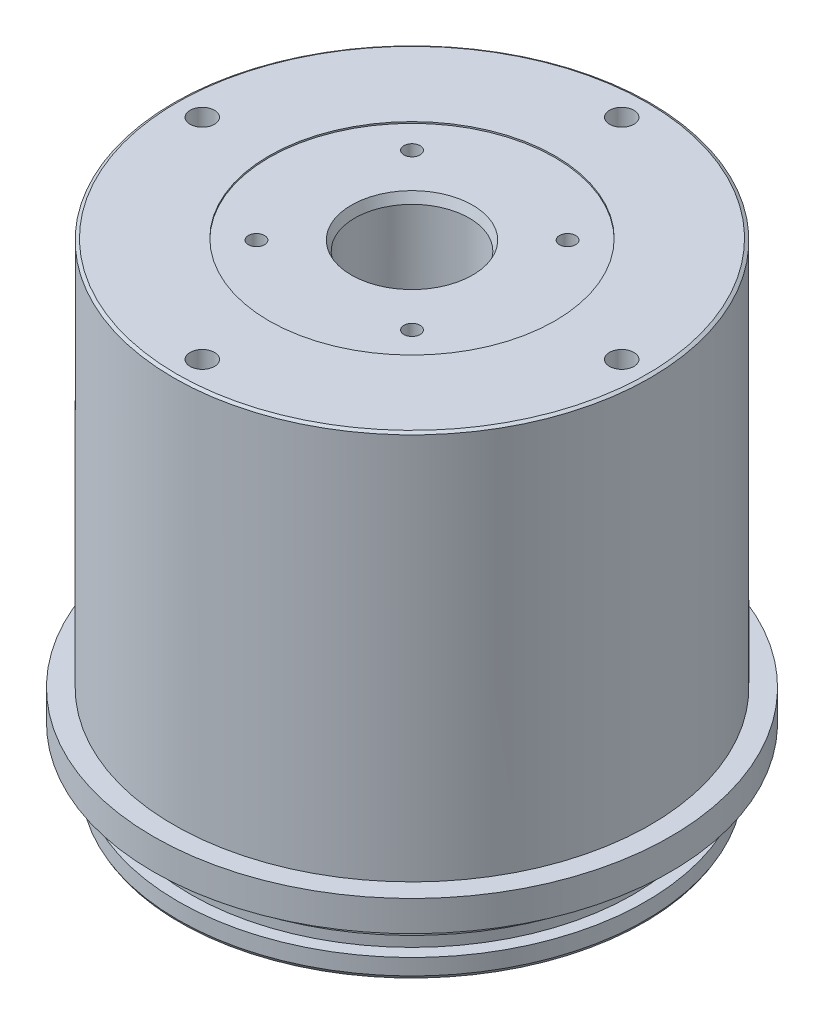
ISO-10303-21;
HEADER;
FILE_DESCRIPTION(('STEP AP214'),'2;1');
FILE_NAME('part.step','',(''),(''),'','','');
FILE_SCHEMA(('AUTOMOTIVE_DESIGN { 1 0 10303 214 1 1 1 1 }'));
ENDSEC;
DATA;
#1=APPLICATION_CONTEXT('core data for automotive mechanical design processes');
#2=APPLICATION_PROTOCOL_DEFINITION('international standard','automotive_design',2000,#1);
#3=PRODUCT_CONTEXT('',#1,'mechanical');
#4=PRODUCT('Part','Part','',(#3));
#5=PRODUCT_RELATED_PRODUCT_CATEGORY('part','',(#4));
#6=PRODUCT_DEFINITION_FORMATION('','',#4);
#7=PRODUCT_DEFINITION_CONTEXT('part definition',#1,'design');
#8=PRODUCT_DEFINITION('design','',#6,#7);
#9=PRODUCT_DEFINITION_SHAPE('','',#8);
#10=(LENGTH_UNIT() NAMED_UNIT(*) SI_UNIT(.MILLI.,.METRE.));
#11=(NAMED_UNIT(*) PLANE_ANGLE_UNIT() SI_UNIT($,.RADIAN.));
#12=(NAMED_UNIT(*) SI_UNIT($,.STERADIAN.) SOLID_ANGLE_UNIT());
#13=UNCERTAINTY_MEASURE_WITH_UNIT(LENGTH_MEASURE(1.E-05),#10,'distance_accuracy_value','');
#14=(GEOMETRIC_REPRESENTATION_CONTEXT(3) GLOBAL_UNCERTAINTY_ASSIGNED_CONTEXT((#13)) GLOBAL_UNIT_ASSIGNED_CONTEXT((#10,
#11,#12)) REPRESENTATION_CONTEXT('',''));
#15=CARTESIAN_POINT('',(0.,0.,0.));
#16=DIRECTION('',(0.,0.,1.));
#17=DIRECTION('',(1.,0.,0.));
#18=AXIS2_PLACEMENT_3D('',#15,#16,#17);
#19=CARTESIAN_POINT('',(0.,0.,0.));
#20=DIRECTION('',(0.,1.00000000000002,0.));
#21=DIRECTION('',(0.,0.,0.999999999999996));
#22=AXIS2_PLACEMENT_3D('',#19,#20,#21);
#23=CYLINDRICAL_SURFACE('',#22,9.525);
#24=CARTESIAN_POINT('',(0.,77.5462,0.));
#25=DIRECTION('',(0.,1.00000000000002,0.));
#26=DIRECTION('',(0.,0.,0.999999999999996));
#27=AXIS2_PLACEMENT_3D('',#24,#25,#26);
#28=CIRCLE('',#27,9.525);
#29=CARTESIAN_POINT('',(0.,77.5462,9.52499999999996));
#30=VERTEX_POINT('',#29);
#31=EDGE_CURVE('E64',#30,#30,#28,.T.);
#32=ORIENTED_EDGE('',*,*,#31,.T.);
#33=EDGE_LOOP('',(#32));
#34=FACE_BOUND('',#33,.T.);
#35=CARTESIAN_POINT('',(0.,63.5000000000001,0.));
#36=DIRECTION('',(0.,-1.00000000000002,0.));
#37=DIRECTION('',(0.,0.,-0.999999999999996));
#38=AXIS2_PLACEMENT_3D('',#35,#36,#37);
#39=CIRCLE('',#38,9.525);
#40=CARTESIAN_POINT('',(0.,63.5000000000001,-9.52499999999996));
#41=VERTEX_POINT('',#40);
#42=EDGE_CURVE('E77',#41,#41,#39,.T.);
#43=ORIENTED_EDGE('',*,*,#42,.T.);
#44=EDGE_LOOP('',(#43));
#45=FACE_BOUND('',#44,.T.);
#46=ADVANCED_FACE('F44',(#34,#45),#23,.F.);
#47=CARTESIAN_POINT('',(0.,0.,0.));
#48=DIRECTION('',(0.,-1.00000000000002,0.));
#49=DIRECTION('',(0.,0.,-0.999999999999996));
#50=AXIS2_PLACEMENT_3D('',#47,#48,#49);
#51=PLANE('',#50);
#52=CARTESIAN_POINT('',(0.,0.,0.));
#53=DIRECTION('',(0.,-1.00000000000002,0.));
#54=DIRECTION('',(0.,0.,-0.999999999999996));
#55=AXIS2_PLACEMENT_3D('',#52,#53,#54);
#56=CIRCLE('',#55,38.6322060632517);
#57=CARTESIAN_POINT('',(0.,0.,-38.6322060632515));
#58=VERTEX_POINT('',#57);
#59=EDGE_CURVE('E73',#58,#58,#56,.T.);
#60=ORIENTED_EDGE('',*,*,#59,.T.);
#61=EDGE_LOOP('',(#60));
#62=FACE_BOUND('',#61,.T.);
#63=CARTESIAN_POINT('',(0.,0.,0.));
#64=DIRECTION('',(0.,-1.00000000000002,0.));
#65=DIRECTION('',(0.,0.,-0.999999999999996));
#66=AXIS2_PLACEMENT_3D('',#63,#64,#65);
#67=CIRCLE('',#66,31.75);
#68=CARTESIAN_POINT('',(0.,0.,-31.7499999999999));
#69=VERTEX_POINT('',#68);
#70=EDGE_CURVE('E80',#69,#69,#67,.T.);
#71=ORIENTED_EDGE('',*,*,#70,.F.);
#72=EDGE_LOOP('',(#71));
#73=FACE_BOUND('',#72,.T.);
#74=ADVANCED_FACE('F264',(#62,#73),#51,.T.);
#75=CARTESIAN_POINT('',(0.,0.,0.));
#76=DIRECTION('',(0.,-1.00000000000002,0.));
#77=DIRECTION('',(0.,0.,-0.999999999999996));
#78=AXIS2_PLACEMENT_3D('',#75,#76,#77);
#79=CYLINDRICAL_SURFACE('',#78,38.9255);
#80=CARTESIAN_POINT('',(0.,0.507999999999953,0.));
#81=DIRECTION('',(0.,-1.00000000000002,0.));
#82=DIRECTION('',(0.,0.,-0.999999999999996));
#83=AXIS2_PLACEMENT_3D('',#80,#81,#82);
#84=CIRCLE('',#83,38.9255);
#85=CARTESIAN_POINT('',(0.,0.507999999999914,-38.9254999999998));
#86=VERTEX_POINT('',#85);
#87=EDGE_CURVE('E70',#86,#86,#84,.F.);
#88=ORIENTED_EDGE('',*,*,#87,.T.);
#89=EDGE_LOOP('',(#88));
#90=FACE_BOUND('',#89,.T.);
#91=CARTESIAN_POINT('',(0.,3.17499999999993,0.));
#92=DIRECTION('',(0.,-1.00000000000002,0.));
#93=DIRECTION('',(0.,0.,-0.999999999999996));
#94=AXIS2_PLACEMENT_3D('',#91,#92,#93);
#95=CIRCLE('',#94,38.9255);
#96=CARTESIAN_POINT('',(0.,3.17499999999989,-38.9254999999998));
#97=VERTEX_POINT('',#96);
#98=EDGE_CURVE('E76',#97,#97,#95,.T.);
#99=ORIENTED_EDGE('',*,*,#98,.T.);
#100=EDGE_LOOP('',(#99));
#101=FACE_BOUND('',#100,.T.);
#102=ADVANCED_FACE('F270',(#90,#101),#79,.T.);
#103=CARTESIAN_POINT('',(38.9254999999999,3.17499999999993,0.));
#104=DIRECTION('',(0.,1.00000000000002,0.));
#105=DIRECTION('',(0.,0.,0.999999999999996));
#106=AXIS2_PLACEMENT_3D('',#103,#104,#105);
#107=PLANE('',#106);
#108=CARTESIAN_POINT('',(0.,3.17499999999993,0.));
#109=DIRECTION('',(0.,-1.00000000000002,0.));
#110=DIRECTION('',(0.,0.,-0.999999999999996));
#111=AXIS2_PLACEMENT_3D('',#108,#109,#110);
#112=CIRCLE('',#111,36.8681);
#113=CARTESIAN_POINT('',(0.,3.17499999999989,-36.8680999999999));
#114=VERTEX_POINT('',#113);
#115=EDGE_CURVE('E84',#114,#114,#112,.T.);
#116=ORIENTED_EDGE('',*,*,#115,.T.);
#117=EDGE_LOOP('',(#116));
#118=FACE_BOUND('',#117,.T.);
#119=ORIENTED_EDGE('',*,*,#98,.F.);
#120=EDGE_LOOP('',(#119));
#121=FACE_BOUND('',#120,.T.);
#122=ADVANCED_FACE('F325',(#118,#121),#107,.T.);
#123=CARTESIAN_POINT('',(0.,0.,0.));
#124=DIRECTION('',(0.,-1.00000000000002,0.));
#125=DIRECTION('',(0.,0.,-0.999999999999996));
#126=AXIS2_PLACEMENT_3D('',#123,#124,#125);
#127=CYLINDRICAL_SURFACE('',#126,36.8681);
#128=CARTESIAN_POINT('',(0.,6.35000000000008,0.));
#129=DIRECTION('',(0.,-1.00000000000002,0.));
#130=DIRECTION('',(0.,0.,-0.999999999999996));
#131=AXIS2_PLACEMENT_3D('',#128,#129,#130);
#132=CIRCLE('',#131,36.8681);
#133=CARTESIAN_POINT('',(0.,6.35000000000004,-36.8680999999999));
#134=VERTEX_POINT('',#133);
#135=EDGE_CURVE('E87',#134,#134,#132,.T.);
#136=ORIENTED_EDGE('',*,*,#135,.T.);
#137=EDGE_LOOP('',(#136));
#138=FACE_BOUND('',#137,.T.);
#139=ORIENTED_EDGE('',*,*,#115,.F.);
#140=EDGE_LOOP('',(#139));
#141=FACE_BOUND('',#140,.T.);
#142=ADVANCED_FACE('F321',(#138,#141),#127,.T.);
#143=CARTESIAN_POINT('',(36.8681,6.35000000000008,0.));
#144=DIRECTION('',(0.,-1.00000000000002,0.));
#145=DIRECTION('',(0.,0.,-0.999999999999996));
#146=AXIS2_PLACEMENT_3D('',#143,#144,#145);
#147=PLANE('',#146);
#148=CARTESIAN_POINT('',(0.,6.35000000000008,0.));
#149=DIRECTION('',(0.,-1.00000000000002,0.));
#150=DIRECTION('',(0.,0.,-0.999999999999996));
#151=AXIS2_PLACEMENT_3D('',#148,#149,#150);
#152=CIRCLE('',#151,38.9255);
#153=CARTESIAN_POINT('',(0.,6.35000000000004,-38.9254999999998));
#154=VERTEX_POINT('',#153);
#155=EDGE_CURVE('E90',#154,#154,#152,.T.);
#156=ORIENTED_EDGE('',*,*,#155,.T.);
#157=EDGE_LOOP('',(#156));
#158=FACE_BOUND('',#157,.T.);
#159=ORIENTED_EDGE('',*,*,#135,.F.);
#160=EDGE_LOOP('',(#159));
#161=FACE_BOUND('',#160,.T.);
#162=ADVANCED_FACE('F317',(#158,#161),#147,.T.);
#163=CARTESIAN_POINT('',(0.,0.,0.));
#164=DIRECTION('',(0.,-1.00000000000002,0.));
#165=DIRECTION('',(0.,0.,-0.999999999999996));
#166=AXIS2_PLACEMENT_3D('',#163,#164,#165);
#167=CYLINDRICAL_SURFACE('',#166,38.9255);
#168=CARTESIAN_POINT('',(0.,9.52500000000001,0.));
#169=DIRECTION('',(0.,-1.00000000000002,0.));
#170=DIRECTION('',(0.,0.,-0.999999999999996));
#171=AXIS2_PLACEMENT_3D('',#168,#169,#170);
#172=CIRCLE('',#171,38.9255);
#173=CARTESIAN_POINT('',(0.,9.52499999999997,-38.9254999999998));
#174=VERTEX_POINT('',#173);
#175=EDGE_CURVE('E93',#174,#174,#172,.T.);
#176=ORIENTED_EDGE('',*,*,#175,.T.);
#177=EDGE_LOOP('',(#176));
#178=FACE_BOUND('',#177,.T.);
#179=ORIENTED_EDGE('',*,*,#155,.F.);
#180=EDGE_LOOP('',(#179));
#181=FACE_BOUND('',#180,.T.);
#182=ADVANCED_FACE('F313',(#178,#181),#167,.T.);
#183=CARTESIAN_POINT('',(38.9254999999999,9.52500000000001,0.));
#184=DIRECTION('',(0.,-1.00000000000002,0.));
#185=DIRECTION('',(0.,0.,-0.999999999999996));
#186=AXIS2_PLACEMENT_3D('',#183,#184,#185);
#187=PLANE('',#186);
#188=CARTESIAN_POINT('',(0.,9.52500000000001,0.));
#189=DIRECTION('',(0.,-1.00000000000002,0.));
#190=DIRECTION('',(0.,0.,-0.999999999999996));
#191=AXIS2_PLACEMENT_3D('',#188,#189,#190);
#192=CIRCLE('',#191,40.005);
#193=CARTESIAN_POINT('',(0.,9.52499999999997,-40.0049999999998));
#194=VERTEX_POINT('',#193);
#195=EDGE_CURVE('E96',#194,#194,#192,.T.);
#196=ORIENTED_EDGE('',*,*,#195,.T.);
#197=EDGE_LOOP('',(#196));
#198=FACE_BOUND('',#197,.T.);
#199=ORIENTED_EDGE('',*,*,#175,.F.);
#200=EDGE_LOOP('',(#199));
#201=FACE_BOUND('',#200,.T.);
#202=ADVANCED_FACE('F309',(#198,#201),#187,.T.);
#203=CARTESIAN_POINT('',(0.,0.,0.));
#204=DIRECTION('',(0.,-1.00000000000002,0.));
#205=DIRECTION('',(0.,0.,-0.999999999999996));
#206=AXIS2_PLACEMENT_3D('',#203,#204,#205);
#207=CYLINDRICAL_SURFACE('',#206,40.005);
#208=CARTESIAN_POINT('',(0.,10.6679999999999,0.));
#209=DIRECTION('',(0.,-1.00000000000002,0.));
#210=DIRECTION('',(0.,0.,-0.999999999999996));
#211=AXIS2_PLACEMENT_3D('',#208,#209,#210);
#212=CIRCLE('',#211,40.005);
#213=CARTESIAN_POINT('',(0.,10.6679999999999,-40.0049999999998));
#214=VERTEX_POINT('',#213);
#215=EDGE_CURVE('E99',#214,#214,#212,.T.);
#216=ORIENTED_EDGE('',*,*,#215,.T.);
#217=EDGE_LOOP('',(#216));
#218=FACE_BOUND('',#217,.T.);
#219=ORIENTED_EDGE('',*,*,#195,.F.);
#220=EDGE_LOOP('',(#219));
#221=FACE_BOUND('',#220,.T.);
#222=ADVANCED_FACE('F305',(#218,#221),#207,.T.);
#223=CARTESIAN_POINT('',(40.005,10.6679999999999,0.));
#224=DIRECTION('',(0.,-1.00000000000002,0.));
#225=DIRECTION('',(0.,0.,-0.999999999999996));
#226=AXIS2_PLACEMENT_3D('',#223,#224,#225);
#227=PLANE('',#226);
#228=CARTESIAN_POINT('',(0.,10.6679999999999,0.));
#229=DIRECTION('',(0.,-1.00000000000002,0.));
#230=DIRECTION('',(0.,0.,-0.999999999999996));
#231=AXIS2_PLACEMENT_3D('',#228,#229,#230);
#232=CIRCLE('',#231,42.037);
#233=CARTESIAN_POINT('',(0.,10.6679999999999,-42.0369999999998));
#234=VERTEX_POINT('',#233);
#235=EDGE_CURVE('E102',#234,#234,#232,.T.);
#236=ORIENTED_EDGE('',*,*,#235,.T.);
#237=EDGE_LOOP('',(#236));
#238=FACE_BOUND('',#237,.T.);
#239=ORIENTED_EDGE('',*,*,#215,.F.);
#240=EDGE_LOOP('',(#239));
#241=FACE_BOUND('',#240,.T.);
#242=ADVANCED_FACE('F301',(#238,#241),#227,.T.);
#243=CARTESIAN_POINT('',(0.,0.,0.));
#244=DIRECTION('',(0.,-1.00000000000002,0.));
#245=DIRECTION('',(0.,0.,-0.999999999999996));
#246=AXIS2_PLACEMENT_3D('',#243,#244,#245);
#247=CYLINDRICAL_SURFACE('',#246,42.037);
#248=CARTESIAN_POINT('',(0.,9.52500000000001,0.));
#249=DIRECTION('',(0.,-1.00000000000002,0.));
#250=DIRECTION('',(0.,0.,-0.999999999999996));
#251=AXIS2_PLACEMENT_3D('',#248,#249,#250);
#252=CIRCLE('',#251,42.037);
#253=CARTESIAN_POINT('',(0.,9.52499999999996,-42.0369999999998));
#254=VERTEX_POINT('',#253);
#255=EDGE_CURVE('E105',#254,#254,#252,.T.);
#256=ORIENTED_EDGE('',*,*,#255,.T.);
#257=EDGE_LOOP('',(#256));
#258=FACE_BOUND('',#257,.T.);
#259=ORIENTED_EDGE('',*,*,#235,.F.);
#260=EDGE_LOOP('',(#259));
#261=FACE_BOUND('',#260,.T.);
#262=ADVANCED_FACE('F297',(#258,#261),#247,.F.);
#263=CARTESIAN_POINT('',(42.037,9.52500000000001,0.));
#264=DIRECTION('',(0.,-1.00000000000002,0.));
#265=DIRECTION('',(0.,0.,-0.999999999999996));
#266=AXIS2_PLACEMENT_3D('',#263,#264,#265);
#267=PLANE('',#266);
#268=CARTESIAN_POINT('',(0.,9.52500000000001,0.));
#269=DIRECTION('',(0.,-1.00000000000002,0.));
#270=DIRECTION('',(0.,0.,-0.999999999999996));
#271=AXIS2_PLACEMENT_3D('',#268,#269,#270);
#272=CIRCLE('',#271,43.053);
#273=CARTESIAN_POINT('',(0.,9.52499999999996,-43.0529999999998));
#274=VERTEX_POINT('',#273);
#275=EDGE_CURVE('E108',#274,#274,#272,.T.);
#276=ORIENTED_EDGE('',*,*,#275,.T.);
#277=EDGE_LOOP('',(#276));
#278=FACE_BOUND('',#277,.T.);
#279=ORIENTED_EDGE('',*,*,#255,.F.);
#280=EDGE_LOOP('',(#279));
#281=FACE_BOUND('',#280,.T.);
#282=ADVANCED_FACE('F293',(#278,#281),#267,.T.);
#283=CARTESIAN_POINT('',(0.,0.,0.));
#284=DIRECTION('',(0.,-1.00000000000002,0.));
#285=DIRECTION('',(0.,0.,-0.999999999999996));
#286=AXIS2_PLACEMENT_3D('',#283,#284,#285);
#287=CYLINDRICAL_SURFACE('',#286,43.053);
#288=CARTESIAN_POINT('',(0.,14.605,0.));
#289=DIRECTION('',(0.,-1.00000000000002,0.));
#290=DIRECTION('',(0.,0.,-0.999999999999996));
#291=AXIS2_PLACEMENT_3D('',#288,#289,#290);
#292=CIRCLE('',#291,43.053);
#293=CARTESIAN_POINT('',(0.,14.6049999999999,-43.0529999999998));
#294=VERTEX_POINT('',#293);
#295=EDGE_CURVE('E111',#294,#294,#292,.T.);
#296=ORIENTED_EDGE('',*,*,#295,.T.);
#297=EDGE_LOOP('',(#296));
#298=FACE_BOUND('',#297,.T.);
#299=ORIENTED_EDGE('',*,*,#275,.F.);
#300=EDGE_LOOP('',(#299));
#301=FACE_BOUND('',#300,.T.);
#302=ADVANCED_FACE('F289',(#298,#301),#287,.T.);
#303=CARTESIAN_POINT('',(43.053,14.605,0.));
#304=DIRECTION('',(0.,1.00000000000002,0.));
#305=DIRECTION('',(0.,0.,0.999999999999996));
#306=AXIS2_PLACEMENT_3D('',#303,#304,#305);
#307=PLANE('',#306);
#308=CARTESIAN_POINT('',(0.,14.605,0.));
#309=DIRECTION('',(0.,-1.00000000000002,0.));
#310=DIRECTION('',(0.,0.,-0.999999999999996));
#311=AXIS2_PLACEMENT_3D('',#308,#309,#310);
#312=CIRCLE('',#311,39.6748);
#313=CARTESIAN_POINT('',(0.,14.6049999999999,-39.6747999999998));
#314=VERTEX_POINT('',#313);
#315=EDGE_CURVE('E114',#314,#314,#312,.T.);
#316=ORIENTED_EDGE('',*,*,#315,.T.);
#317=EDGE_LOOP('',(#316));
#318=FACE_BOUND('',#317,.T.);
#319=ORIENTED_EDGE('',*,*,#295,.F.);
#320=EDGE_LOOP('',(#319));
#321=FACE_BOUND('',#320,.T.);
#322=ADVANCED_FACE('F285',(#318,#321),#307,.T.);
#323=CARTESIAN_POINT('',(0.,0.,0.));
#324=DIRECTION('',(0.,-1.00000000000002,0.));
#325=DIRECTION('',(0.,0.,-0.999999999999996));
#326=AXIS2_PLACEMENT_3D('',#323,#324,#325);
#327=CYLINDRICAL_SURFACE('',#326,39.6748);
#328=CARTESIAN_POINT('',(0.,79.0817060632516,0.));
#329=DIRECTION('',(0.,1.00000000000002,0.));
#330=DIRECTION('',(0.,0.,0.999999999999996));
#331=AXIS2_PLACEMENT_3D('',#328,#329,#330);
#332=CIRCLE('',#331,39.6748);
#333=CARTESIAN_POINT('',(0.,79.0817060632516,39.6747999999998));
#334=VERTEX_POINT('',#333);
#335=EDGE_CURVE('E59',#334,#334,#332,.F.);
#336=ORIENTED_EDGE('',*,*,#335,.T.);
#337=EDGE_LOOP('',(#336));
#338=FACE_BOUND('',#337,.T.);
#339=ORIENTED_EDGE('',*,*,#315,.F.);
#340=EDGE_LOOP('',(#339));
#341=FACE_BOUND('',#340,.T.);
#342=ADVANCED_FACE('F234',(#338,#341),#327,.T.);
#343=CARTESIAN_POINT('',(39.6748,79.375,0.));
#344=DIRECTION('',(0.,1.00000000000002,0.));
#345=DIRECTION('',(0.,0.,0.999999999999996));
#346=AXIS2_PLACEMENT_3D('',#343,#344,#345);
#347=PLANE('',#346);
#348=CARTESIAN_POINT('',(0.,79.375,0.));
#349=DIRECTION('',(0.,1.00000000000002,0.));
#350=DIRECTION('',(0.,0.,0.999999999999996));
#351=AXIS2_PLACEMENT_3D('',#348,#349,#350);
#352=CIRCLE('',#351,39.1668);
#353=CARTESIAN_POINT('',(0.,79.375,39.1667999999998));
#354=VERTEX_POINT('',#353);
#355=EDGE_CURVE('E55',#354,#354,#352,.T.);
#356=ORIENTED_EDGE('',*,*,#355,.T.);
#357=EDGE_LOOP('',(#356));
#358=FACE_BOUND('',#357,.T.);
#359=CARTESIAN_POINT('',(0.,79.375,34.925));
#360=DIRECTION('',(0.,1.00000000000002,0.));
#361=DIRECTION('',(0.,0.,0.999999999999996));
#362=AXIS2_PLACEMENT_3D('',#359,#360,#361);
#363=CIRCLE('',#362,2.032);
#364=CARTESIAN_POINT('',(0.,79.375,36.957));
#365=VERTEX_POINT('',#364);
#366=EDGE_CURVE('E215',#365,#365,#363,.T.);
#367=ORIENTED_EDGE('',*,*,#366,.F.);
#368=EDGE_LOOP('',(#367));
#369=FACE_BOUND('',#368,.T.);
#370=CARTESIAN_POINT('',(34.925,79.375,0.));
#371=DIRECTION('',(0.,1.00000000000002,0.));
#372=DIRECTION('',(0.,0.,0.999999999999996));
#373=AXIS2_PLACEMENT_3D('',#370,#371,#372);
#374=CIRCLE('',#373,2.032);
#375=CARTESIAN_POINT('',(34.925,79.375,2.03199999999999));
#376=VERTEX_POINT('',#375);
#377=EDGE_CURVE('E209',#376,#376,#374,.T.);
#378=ORIENTED_EDGE('',*,*,#377,.F.);
#379=EDGE_LOOP('',(#378));
#380=FACE_BOUND('',#379,.T.);
#381=CARTESIAN_POINT('',(-34.925,79.375,0.));
#382=DIRECTION('',(0.,1.00000000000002,0.));
#383=DIRECTION('',(0.,0.,0.999999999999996));
#384=AXIS2_PLACEMENT_3D('',#381,#382,#383);
#385=CIRCLE('',#384,2.032);
#386=CARTESIAN_POINT('',(-34.925,79.375,2.03199999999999));
#387=VERTEX_POINT('',#386);
#388=EDGE_CURVE('E203',#387,#387,#385,.T.);
#389=ORIENTED_EDGE('',*,*,#388,.F.);
#390=EDGE_LOOP('',(#389));
#391=FACE_BOUND('',#390,.T.);
#392=CARTESIAN_POINT('',(0.,79.375,-34.925));
#393=DIRECTION('',(0.,1.00000000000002,0.));
#394=DIRECTION('',(0.,0.,0.999999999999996));
#395=AXIS2_PLACEMENT_3D('',#392,#393,#394);
#396=CIRCLE('',#395,2.032);
#397=CARTESIAN_POINT('',(0.,79.375,-32.893));
#398=VERTEX_POINT('',#397);
#399=EDGE_CURVE('E197',#398,#398,#396,.T.);
#400=ORIENTED_EDGE('',*,*,#399,.F.);
#401=EDGE_LOOP('',(#400));
#402=FACE_BOUND('',#401,.T.);
#403=CARTESIAN_POINT('',(0.,79.375,0.));
#404=DIRECTION('',(0.,1.00000000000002,0.));
#405=DIRECTION('',(0.,0.,0.999999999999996));
#406=AXIS2_PLACEMENT_3D('',#403,#404,#405);
#407=CIRCLE('',#406,23.8125);
#408=CARTESIAN_POINT('',(0.,79.375,23.8124999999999));
#409=VERTEX_POINT('',#408);
#410=EDGE_CURVE('E167',#409,#409,#407,.T.);
#411=ORIENTED_EDGE('',*,*,#410,.F.);
#412=EDGE_LOOP('',(#411));
#413=FACE_BOUND('',#412,.T.);
#414=ADVANCED_FACE('F230',(#358,#369,#380,#391,#402,#413),#347,.T.);
#415=CARTESIAN_POINT('',(0.,63.5000000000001,0.));
#416=DIRECTION('',(0.,-1.00000000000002,0.));
#417=DIRECTION('',(0.,0.,-0.999999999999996));
#418=AXIS2_PLACEMENT_3D('',#415,#416,#417);
#419=CYLINDRICAL_SURFACE('',#418,31.75);
#420=CARTESIAN_POINT('',(0.,62.23,0.));
#421=DIRECTION('',(0.,-1.00000000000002,0.));
#422=DIRECTION('',(0.,0.,-0.999999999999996));
#423=AXIS2_PLACEMENT_3D('',#420,#421,#422);
#424=CIRCLE('',#423,31.75);
#425=CARTESIAN_POINT('',(0.,62.23,-31.7499999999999));
#426=VERTEX_POINT('',#425);
#427=EDGE_CURVE('E12',#426,#426,#424,.F.);
#428=ORIENTED_EDGE('',*,*,#427,.T.);
#429=EDGE_LOOP('',(#428));
#430=FACE_BOUND('',#429,.T.);
#431=ORIENTED_EDGE('',*,*,#70,.T.);
#432=EDGE_LOOP('',(#431));
#433=FACE_BOUND('',#432,.T.);
#434=ADVANCED_FACE('F233',(#430,#433),#419,.F.);
#435=CARTESIAN_POINT('',(0.,63.5000000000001,0.));
#436=DIRECTION('',(0.,-1.00000000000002,0.));
#437=DIRECTION('',(0.,0.,-0.999999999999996));
#438=AXIS2_PLACEMENT_3D('',#435,#436,#437);
#439=PLANE('',#438);
#440=CARTESIAN_POINT('',(0.,63.5000000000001,0.));
#441=DIRECTION('',(0.,-1.00000000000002,0.));
#442=DIRECTION('',(0.,0.,-0.999999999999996));
#443=AXIS2_PLACEMENT_3D('',#440,#441,#442);
#444=CIRCLE('',#443,30.48);
#445=CARTESIAN_POINT('',(0.,63.5000000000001,-30.4799999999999));
#446=VERTEX_POINT('',#445);
#447=EDGE_CURVE('E51',#446,#446,#444,.T.);
#448=ORIENTED_EDGE('',*,*,#447,.T.);
#449=EDGE_LOOP('',(#448));
#450=FACE_BOUND('',#449,.T.);
#451=CARTESIAN_POINT('',(-17.9605122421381,63.5000000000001,17.9605122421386));
#452=DIRECTION('',(0.,-1.00000000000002,0.));
#453=DIRECTION('',(0.707106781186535,0.,-0.707106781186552));
#454=AXIS2_PLACEMENT_3D('',#451,#452,#453);
#455=CIRCLE('',#454,2.032);
#456=CARTESIAN_POINT('',(-16.5236712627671,63.5000000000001,16.5236712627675));
#457=VERTEX_POINT('',#456);
#458=EDGE_CURVE('E161',#457,#457,#455,.T.);
#459=ORIENTED_EDGE('',*,*,#458,.F.);
#460=EDGE_LOOP('',(#459));
#461=FACE_BOUND('',#460,.T.);
#462=CARTESIAN_POINT('',(-25.4,63.5000000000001,2.22044604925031E-13));
#463=DIRECTION('',(0.,-1.00000000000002,0.));
#464=DIRECTION('',(0.999999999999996,0.,0.));
#465=AXIS2_PLACEMENT_3D('',#462,#463,#464);
#466=CIRCLE('',#465,2.032);
#467=CARTESIAN_POINT('',(-23.368,63.5000000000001,2.00760534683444E-13));
#468=VERTEX_POINT('',#467);
#469=EDGE_CURVE('E155',#468,#468,#466,.T.);
#470=ORIENTED_EDGE('',*,*,#469,.F.);
#471=EDGE_LOOP('',(#470));
#472=FACE_BOUND('',#471,.T.);
#473=CARTESIAN_POINT('',(-17.9605122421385,63.5000000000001,-17.9605122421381));
#474=DIRECTION('',(0.,-1.00000000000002,0.));
#475=DIRECTION('',(0.70710678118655,0.,0.707106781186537));
#476=AXIS2_PLACEMENT_3D('',#473,#474,#475);
#477=CIRCLE('',#476,2.032);
#478=CARTESIAN_POINT('',(-16.5236712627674,63.5000000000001,-16.5236712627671));
#479=VERTEX_POINT('',#478);
#480=EDGE_CURVE('E149',#479,#479,#477,.T.);
#481=ORIENTED_EDGE('',*,*,#480,.F.);
#482=EDGE_LOOP('',(#481));
#483=FACE_BOUND('',#482,.T.);
#484=CARTESIAN_POINT('',(0.,63.5000000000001,-25.4));
#485=DIRECTION('',(0.,-1.00000000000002,0.));
#486=DIRECTION('',(0.,0.,0.999999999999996));
#487=AXIS2_PLACEMENT_3D('',#484,#485,#486);
#488=CIRCLE('',#487,2.032);
#489=CARTESIAN_POINT('',(0.,63.5000000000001,-23.368));
#490=VERTEX_POINT('',#489);
#491=EDGE_CURVE('E143',#490,#490,#488,.T.);
#492=ORIENTED_EDGE('',*,*,#491,.F.);
#493=EDGE_LOOP('',(#492));
#494=FACE_BOUND('',#493,.T.);
#495=CARTESIAN_POINT('',(17.9605122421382,63.5000000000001,-17.9605122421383));
#496=DIRECTION('',(0.,-1.00000000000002,0.));
#497=DIRECTION('',(-0.70710678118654,0.,0.707106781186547));
#498=AXIS2_PLACEMENT_3D('',#495,#496,#497);
#499=CIRCLE('',#498,2.032);
#500=CARTESIAN_POINT('',(16.5236712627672,63.5000000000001,-16.5236712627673));
#501=VERTEX_POINT('',#500);
#502=EDGE_CURVE('E137',#501,#501,#499,.T.);
#503=ORIENTED_EDGE('',*,*,#502,.F.);
#504=EDGE_LOOP('',(#503));
#505=FACE_BOUND('',#504,.T.);
#506=CARTESIAN_POINT('',(25.4,63.5000000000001,-1.11022302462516E-13));
#507=DIRECTION('',(0.,-1.00000000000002,0.));
#508=DIRECTION('',(-0.999999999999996,0.,0.));
#509=AXIS2_PLACEMENT_3D('',#506,#507,#508);
#510=CIRCLE('',#509,2.032);
#511=CARTESIAN_POINT('',(23.368,63.5000000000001,-1.03927612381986E-13));
#512=VERTEX_POINT('',#511);
#513=EDGE_CURVE('E131',#512,#512,#510,.T.);
#514=ORIENTED_EDGE('',*,*,#513,.F.);
#515=EDGE_LOOP('',(#514));
#516=FACE_BOUND('',#515,.T.);
#517=CARTESIAN_POINT('',(17.9605122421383,63.5000000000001,17.9605122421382));
#518=DIRECTION('',(0.,-1.00000000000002,0.));
#519=DIRECTION('',(-0.707106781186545,0.,-0.707106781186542));
#520=AXIS2_PLACEMENT_3D('',#517,#518,#519);
#521=CIRCLE('',#520,2.032);
#522=CARTESIAN_POINT('',(16.5236712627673,63.5000000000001,16.5236712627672));
#523=VERTEX_POINT('',#522);
#524=EDGE_CURVE('E125',#523,#523,#521,.T.);
#525=ORIENTED_EDGE('',*,*,#524,.F.);
#526=EDGE_LOOP('',(#525));
#527=FACE_BOUND('',#526,.T.);
#528=CARTESIAN_POINT('',(0.,63.5000000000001,25.4));
#529=DIRECTION('',(0.,-1.00000000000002,0.));
#530=DIRECTION('',(0.,0.,-0.999999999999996));
#531=AXIS2_PLACEMENT_3D('',#528,#529,#530);
#532=CIRCLE('',#531,2.032);
#533=CARTESIAN_POINT('',(0.,63.5000000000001,23.368));
#534=VERTEX_POINT('',#533);
#535=EDGE_CURVE('E119',#534,#534,#532,.T.);
#536=ORIENTED_EDGE('',*,*,#535,.F.);
#537=EDGE_LOOP('',(#536));
#538=FACE_BOUND('',#537,.T.);
#539=ORIENTED_EDGE('',*,*,#42,.F.);
#540=EDGE_LOOP('',(#539));
#541=FACE_BOUND('',#540,.T.);
#542=ADVANCED_FACE('F278',(#450,#461,#472,#483,#494,#505,#516,#527,#538,#541),#439,.T.);
#543=CARTESIAN_POINT('',(0.,73.0250000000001,25.4));
#544=DIRECTION('',(0.,-1.00000000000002,0.));
#545=DIRECTION('',(0.,0.,-0.999999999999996));
#546=AXIS2_PLACEMENT_3D('',#543,#544,#545);
#547=CYLINDRICAL_SURFACE('',#546,2.032);
#548=CARTESIAN_POINT('',(0.,73.0250000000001,25.4));
#549=DIRECTION('',(0.,-1.00000000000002,0.));
#550=DIRECTION('',(0.,0.,-0.999999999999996));
#551=AXIS2_PLACEMENT_3D('',#548,#549,#550);
#552=CIRCLE('',#551,2.032);
#553=CARTESIAN_POINT('',(0.,73.0250000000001,23.368));
#554=VERTEX_POINT('',#553);
#555=EDGE_CURVE('E81',#554,#554,#552,.T.);
#556=ORIENTED_EDGE('',*,*,#555,.F.);
#557=EDGE_LOOP('',(#556));
#558=FACE_BOUND('',#557,.T.);
#559=ORIENTED_EDGE('',*,*,#535,.T.);
#560=EDGE_LOOP('',(#559));
#561=FACE_BOUND('',#560,.T.);
#562=ADVANCED_FACE('F276',(#558,#561),#547,.F.);
#563=CARTESIAN_POINT('',(0.,73.0250000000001,25.4));
#564=DIRECTION('',(0.,-1.00000000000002,0.));
#565=DIRECTION('',(0.,0.,-0.999999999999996));
#566=AXIS2_PLACEMENT_3D('',#563,#564,#565);
#567=PLANE('',#566);
#568=ORIENTED_EDGE('',*,*,#555,.T.);
#569=EDGE_LOOP('',(#568));
#570=FACE_BOUND('',#569,.T.);
#571=ADVANCED_FACE('F686',(#570),#567,.T.);
#572=CARTESIAN_POINT('',(17.9605122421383,73.0250000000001,17.9605122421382));
#573=DIRECTION('',(0.,-1.00000000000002,0.));
#574=DIRECTION('',(0.,0.,-0.999999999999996));
#575=AXIS2_PLACEMENT_3D('',#572,#573,#574);
#576=CYLINDRICAL_SURFACE('',#575,2.032);
#577=CARTESIAN_POINT('',(17.9605122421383,73.0250000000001,17.9605122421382));
#578=DIRECTION('',(0.,-1.00000000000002,0.));
#579=DIRECTION('',(-0.707106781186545,0.,-0.707106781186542));
#580=AXIS2_PLACEMENT_3D('',#577,#578,#579);
#581=CIRCLE('',#580,2.032);
#582=CARTESIAN_POINT('',(16.5236712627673,73.0250000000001,16.5236712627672));
#583=VERTEX_POINT('',#582);
#584=EDGE_CURVE('E122',#583,#583,#581,.T.);
#585=ORIENTED_EDGE('',*,*,#584,.F.);
#586=EDGE_LOOP('',(#585));
#587=FACE_BOUND('',#586,.T.);
#588=ORIENTED_EDGE('',*,*,#524,.T.);
#589=EDGE_LOOP('',(#588));
#590=FACE_BOUND('',#589,.T.);
#591=ADVANCED_FACE('F677',(#587,#590),#576,.F.);
#592=CARTESIAN_POINT('',(17.9605122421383,73.0250000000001,17.9605122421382));
#593=DIRECTION('',(0.,-1.00000000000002,0.));
#594=DIRECTION('',(-0.707106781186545,0.,-0.707106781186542));
#595=AXIS2_PLACEMENT_3D('',#592,#593,#594);
#596=PLANE('',#595);
#597=ORIENTED_EDGE('',*,*,#584,.T.);
#598=EDGE_LOOP('',(#597));
#599=FACE_BOUND('',#598,.T.);
#600=ADVANCED_FACE('F668',(#599),#596,.T.);
#601=CARTESIAN_POINT('',(25.4,73.0250000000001,-1.11022302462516E-13));
#602=DIRECTION('',(0.,-1.00000000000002,0.));
#603=DIRECTION('',(0.,0.,-0.999999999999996));
#604=AXIS2_PLACEMENT_3D('',#601,#602,#603);
#605=CYLINDRICAL_SURFACE('',#604,2.032);
#606=CARTESIAN_POINT('',(25.4,73.0250000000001,-1.11022302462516E-13));
#607=DIRECTION('',(0.,-1.00000000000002,0.));
#608=DIRECTION('',(-0.999999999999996,0.,0.));
#609=AXIS2_PLACEMENT_3D('',#606,#607,#608);
#610=CIRCLE('',#609,2.032);
#611=CARTESIAN_POINT('',(23.368,73.0250000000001,-1.03927612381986E-13));
#612=VERTEX_POINT('',#611);
#613=EDGE_CURVE('E128',#612,#612,#610,.T.);
#614=ORIENTED_EDGE('',*,*,#613,.F.);
#615=EDGE_LOOP('',(#614));
#616=FACE_BOUND('',#615,.T.);
#617=ORIENTED_EDGE('',*,*,#513,.T.);
#618=EDGE_LOOP('',(#617));
#619=FACE_BOUND('',#618,.T.);
#620=ADVANCED_FACE('F659',(#616,#619),#605,.F.);
#621=CARTESIAN_POINT('',(25.4,73.0250000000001,-1.11022302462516E-13));
#622=DIRECTION('',(0.,-1.00000000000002,0.));
#623=DIRECTION('',(-0.999999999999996,0.,0.));
#624=AXIS2_PLACEMENT_3D('',#621,#622,#623);
#625=PLANE('',#624);
#626=ORIENTED_EDGE('',*,*,#613,.T.);
#627=EDGE_LOOP('',(#626));
#628=FACE_BOUND('',#627,.T.);
#629=ADVANCED_FACE('F650',(#628),#625,.T.);
#630=CARTESIAN_POINT('',(17.9605122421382,73.0250000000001,-17.9605122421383));
#631=DIRECTION('',(0.,-1.00000000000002,0.));
#632=DIRECTION('',(0.,0.,-0.999999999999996));
#633=AXIS2_PLACEMENT_3D('',#630,#631,#632);
#634=CYLINDRICAL_SURFACE('',#633,2.032);
#635=CARTESIAN_POINT('',(17.9605122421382,73.0250000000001,-17.9605122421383));
#636=DIRECTION('',(0.,-1.00000000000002,0.));
#637=DIRECTION('',(-0.70710678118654,0.,0.707106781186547));
#638=AXIS2_PLACEMENT_3D('',#635,#636,#637);
#639=CIRCLE('',#638,2.032);
#640=CARTESIAN_POINT('',(16.5236712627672,73.0250000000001,-16.5236712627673));
#641=VERTEX_POINT('',#640);
#642=EDGE_CURVE('E134',#641,#641,#639,.T.);
#643=ORIENTED_EDGE('',*,*,#642,.F.);
#644=EDGE_LOOP('',(#643));
#645=FACE_BOUND('',#644,.T.);
#646=ORIENTED_EDGE('',*,*,#502,.T.);
#647=EDGE_LOOP('',(#646));
#648=FACE_BOUND('',#647,.T.);
#649=ADVANCED_FACE('F641',(#645,#648),#634,.F.);
#650=CARTESIAN_POINT('',(17.9605122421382,73.0250000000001,-17.9605122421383));
#651=DIRECTION('',(0.,-1.00000000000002,0.));
#652=DIRECTION('',(-0.70710678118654,0.,0.707106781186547));
#653=AXIS2_PLACEMENT_3D('',#650,#651,#652);
#654=PLANE('',#653);
#655=ORIENTED_EDGE('',*,*,#642,.T.);
#656=EDGE_LOOP('',(#655));
#657=FACE_BOUND('',#656,.T.);
#658=ADVANCED_FACE('F632',(#657),#654,.T.);
#659=CARTESIAN_POINT('',(0.,73.0250000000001,-25.4));
#660=DIRECTION('',(0.,-1.00000000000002,0.));
#661=DIRECTION('',(0.,0.,-0.999999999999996));
#662=AXIS2_PLACEMENT_3D('',#659,#660,#661);
#663=CYLINDRICAL_SURFACE('',#662,2.032);
#664=CARTESIAN_POINT('',(0.,73.0250000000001,-25.4));
#665=DIRECTION('',(0.,-1.00000000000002,0.));
#666=DIRECTION('',(0.,0.,0.999999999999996));
#667=AXIS2_PLACEMENT_3D('',#664,#665,#666);
#668=CIRCLE('',#667,2.032);
#669=CARTESIAN_POINT('',(0.,73.0250000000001,-23.368));
#670=VERTEX_POINT('',#669);
#671=EDGE_CURVE('E140',#670,#670,#668,.T.);
#672=ORIENTED_EDGE('',*,*,#671,.F.);
#673=EDGE_LOOP('',(#672));
#674=FACE_BOUND('',#673,.T.);
#675=ORIENTED_EDGE('',*,*,#491,.T.);
#676=EDGE_LOOP('',(#675));
#677=FACE_BOUND('',#676,.T.);
#678=ADVANCED_FACE('F623',(#674,#677),#663,.F.);
#679=CARTESIAN_POINT('',(0.,73.0250000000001,-25.4));
#680=DIRECTION('',(0.,-1.00000000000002,0.));
#681=DIRECTION('',(0.,0.,0.999999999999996));
#682=AXIS2_PLACEMENT_3D('',#679,#680,#681);
#683=PLANE('',#682);
#684=ORIENTED_EDGE('',*,*,#671,.T.);
#685=EDGE_LOOP('',(#684));
#686=FACE_BOUND('',#685,.T.);
#687=ADVANCED_FACE('F614',(#686),#683,.T.);
#688=CARTESIAN_POINT('',(-17.9605122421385,73.0250000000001,-17.9605122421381));
#689=DIRECTION('',(0.,-1.00000000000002,0.));
#690=DIRECTION('',(0.,0.,-0.999999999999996));
#691=AXIS2_PLACEMENT_3D('',#688,#689,#690);
#692=CYLINDRICAL_SURFACE('',#691,2.032);
#693=CARTESIAN_POINT('',(-17.9605122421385,73.0250000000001,-17.9605122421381));
#694=DIRECTION('',(0.,-1.00000000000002,0.));
#695=DIRECTION('',(0.70710678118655,0.,0.707106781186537));
#696=AXIS2_PLACEMENT_3D('',#693,#694,#695);
#697=CIRCLE('',#696,2.032);
#698=CARTESIAN_POINT('',(-16.5236712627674,73.0250000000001,-16.5236712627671));
#699=VERTEX_POINT('',#698);
#700=EDGE_CURVE('E146',#699,#699,#697,.T.);
#701=ORIENTED_EDGE('',*,*,#700,.F.);
#702=EDGE_LOOP('',(#701));
#703=FACE_BOUND('',#702,.T.);
#704=ORIENTED_EDGE('',*,*,#480,.T.);
#705=EDGE_LOOP('',(#704));
#706=FACE_BOUND('',#705,.T.);
#707=ADVANCED_FACE('F605',(#703,#706),#692,.F.);
#708=CARTESIAN_POINT('',(-17.9605122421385,73.0250000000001,-17.9605122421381));
#709=DIRECTION('',(0.,-1.00000000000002,0.));
#710=DIRECTION('',(0.70710678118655,0.,0.707106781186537));
#711=AXIS2_PLACEMENT_3D('',#708,#709,#710);
#712=PLANE('',#711);
#713=ORIENTED_EDGE('',*,*,#700,.T.);
#714=EDGE_LOOP('',(#713));
#715=FACE_BOUND('',#714,.T.);
#716=ADVANCED_FACE('F596',(#715),#712,.T.);
#717=CARTESIAN_POINT('',(-25.4,73.0250000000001,2.22044604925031E-13));
#718=DIRECTION('',(0.,-1.00000000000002,0.));
#719=DIRECTION('',(0.,0.,-0.999999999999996));
#720=AXIS2_PLACEMENT_3D('',#717,#718,#719);
#721=CYLINDRICAL_SURFACE('',#720,2.032);
#722=CARTESIAN_POINT('',(-25.4,73.0250000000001,2.22044604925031E-13));
#723=DIRECTION('',(0.,-1.00000000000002,0.));
#724=DIRECTION('',(0.999999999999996,0.,0.));
#725=AXIS2_PLACEMENT_3D('',#722,#723,#724);
#726=CIRCLE('',#725,2.032);
#727=CARTESIAN_POINT('',(-23.368,73.0250000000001,2.00760534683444E-13));
#728=VERTEX_POINT('',#727);
#729=EDGE_CURVE('E152',#728,#728,#726,.T.);
#730=ORIENTED_EDGE('',*,*,#729,.F.);
#731=EDGE_LOOP('',(#730));
#732=FACE_BOUND('',#731,.T.);
#733=ORIENTED_EDGE('',*,*,#469,.T.);
#734=EDGE_LOOP('',(#733));
#735=FACE_BOUND('',#734,.T.);
#736=ADVANCED_FACE('F587',(#732,#735),#721,.F.);
#737=CARTESIAN_POINT('',(-25.4,73.0250000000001,2.22044604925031E-13));
#738=DIRECTION('',(0.,-1.00000000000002,0.));
#739=DIRECTION('',(0.999999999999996,0.,0.));
#740=AXIS2_PLACEMENT_3D('',#737,#738,#739);
#741=PLANE('',#740);
#742=ORIENTED_EDGE('',*,*,#729,.T.);
#743=EDGE_LOOP('',(#742));
#744=FACE_BOUND('',#743,.T.);
#745=ADVANCED_FACE('F578',(#744),#741,.T.);
#746=CARTESIAN_POINT('',(-17.9605122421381,73.0250000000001,17.9605122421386));
#747=DIRECTION('',(0.,-1.00000000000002,0.));
#748=DIRECTION('',(0.,0.,-0.999999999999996));
#749=AXIS2_PLACEMENT_3D('',#746,#747,#748);
#750=CYLINDRICAL_SURFACE('',#749,2.032);
#751=CARTESIAN_POINT('',(-17.9605122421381,73.0250000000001,17.9605122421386));
#752=DIRECTION('',(0.,-1.00000000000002,0.));
#753=DIRECTION('',(0.707106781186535,0.,-0.707106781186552));
#754=AXIS2_PLACEMENT_3D('',#751,#752,#753);
#755=CIRCLE('',#754,2.032);
#756=CARTESIAN_POINT('',(-16.5236712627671,73.0250000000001,16.5236712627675));
#757=VERTEX_POINT('',#756);
#758=EDGE_CURVE('E158',#757,#757,#755,.T.);
#759=ORIENTED_EDGE('',*,*,#758,.F.);
#760=EDGE_LOOP('',(#759));
#761=FACE_BOUND('',#760,.T.);
#762=ORIENTED_EDGE('',*,*,#458,.T.);
#763=EDGE_LOOP('',(#762));
#764=FACE_BOUND('',#763,.T.);
#765=ADVANCED_FACE('F570',(#761,#764),#750,.F.);
#766=CARTESIAN_POINT('',(-17.9605122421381,73.0250000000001,17.9605122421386));
#767=DIRECTION('',(0.,-1.00000000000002,0.));
#768=DIRECTION('',(0.707106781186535,0.,-0.707106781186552));
#769=AXIS2_PLACEMENT_3D('',#766,#767,#768);
#770=PLANE('',#769);
#771=ORIENTED_EDGE('',*,*,#758,.T.);
#772=EDGE_LOOP('',(#771));
#773=FACE_BOUND('',#772,.T.);
#774=ADVANCED_FACE('F258',(#773),#770,.T.);
#775=CARTESIAN_POINT('',(0.,79.121,0.));
#776=DIRECTION('',(0.,1.00000000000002,0.));
#777=DIRECTION('',(0.,0.,0.999999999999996));
#778=AXIS2_PLACEMENT_3D('',#775,#776,#777);
#779=PLANE('',#778);
#780=CARTESIAN_POINT('',(0.,79.121,0.));
#781=DIRECTION('',(0.,1.00000000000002,0.));
#782=DIRECTION('',(0.,0.,0.999999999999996));
#783=AXIS2_PLACEMENT_3D('',#780,#781,#782);
#784=CIRCLE('',#783,10.0981803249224);
#785=CARTESIAN_POINT('',(0.,79.121,10.0981803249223));
#786=VERTEX_POINT('',#785);
#787=EDGE_CURVE('E67',#786,#786,#784,.F.);
#788=ORIENTED_EDGE('',*,*,#787,.T.);
#789=EDGE_LOOP('',(#788));
#790=FACE_BOUND('',#789,.T.);
#791=CARTESIAN_POINT('',(12.954,79.121,12.954));
#792=DIRECTION('',(0.,1.00000000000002,0.));
#793=DIRECTION('',(0.,0.,0.999999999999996));
#794=AXIS2_PLACEMENT_3D('',#791,#792,#793);
#795=CIRCLE('',#794,1.3462);
#796=CARTESIAN_POINT('',(12.954,79.121,14.3002));
#797=VERTEX_POINT('',#796);
#798=EDGE_CURVE('E191',#797,#797,#795,.T.);
#799=ORIENTED_EDGE('',*,*,#798,.F.);
#800=EDGE_LOOP('',(#799));
#801=FACE_BOUND('',#800,.T.);
#802=CARTESIAN_POINT('',(-12.954,79.121,12.954));
#803=DIRECTION('',(0.,1.00000000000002,0.));
#804=DIRECTION('',(0.,0.,0.999999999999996));
#805=AXIS2_PLACEMENT_3D('',#802,#803,#804);
#806=CIRCLE('',#805,1.3462);
#807=CARTESIAN_POINT('',(-12.954,79.121,14.3002));
#808=VERTEX_POINT('',#807);
#809=EDGE_CURVE('E185',#808,#808,#806,.T.);
#810=ORIENTED_EDGE('',*,*,#809,.F.);
#811=EDGE_LOOP('',(#810));
#812=FACE_BOUND('',#811,.T.);
#813=CARTESIAN_POINT('',(-12.954,79.121,-12.954));
#814=DIRECTION('',(0.,1.00000000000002,0.));
#815=DIRECTION('',(0.,0.,0.999999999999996));
#816=AXIS2_PLACEMENT_3D('',#813,#814,#815);
#817=CIRCLE('',#816,1.3462);
#818=CARTESIAN_POINT('',(-12.954,79.121,-11.6078));
#819=VERTEX_POINT('',#818);
#820=EDGE_CURVE('E179',#819,#819,#817,.T.);
#821=ORIENTED_EDGE('',*,*,#820,.F.);
#822=EDGE_LOOP('',(#821));
#823=FACE_BOUND('',#822,.T.);
#824=CARTESIAN_POINT('',(12.954,79.121,-12.954));
#825=DIRECTION('',(0.,1.00000000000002,0.));
#826=DIRECTION('',(0.,0.,0.999999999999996));
#827=AXIS2_PLACEMENT_3D('',#824,#825,#826);
#828=CIRCLE('',#827,1.3462);
#829=CARTESIAN_POINT('',(12.954,79.121,-11.6078));
#830=VERTEX_POINT('',#829);
#831=EDGE_CURVE('E173',#830,#830,#828,.T.);
#832=ORIENTED_EDGE('',*,*,#831,.F.);
#833=EDGE_LOOP('',(#832));
#834=FACE_BOUND('',#833,.T.);
#835=CARTESIAN_POINT('',(0.,79.121,0.));
#836=DIRECTION('',(0.,1.00000000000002,0.));
#837=DIRECTION('',(0.,0.,0.999999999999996));
#838=AXIS2_PLACEMENT_3D('',#835,#836,#837);
#839=CIRCLE('',#838,23.8125);
#840=CARTESIAN_POINT('',(0.,79.121,23.8124999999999));
#841=VERTEX_POINT('',#840);
#842=EDGE_CURVE('E164',#841,#841,#839,.T.);
#843=ORIENTED_EDGE('',*,*,#842,.T.);
#844=EDGE_LOOP('',(#843));
#845=FACE_BOUND('',#844,.T.);
#846=ADVANCED_FACE('F248',(#790,#801,#812,#823,#834,#845),#779,.T.);
#847=CARTESIAN_POINT('',(0.,79.121,0.));
#848=DIRECTION('',(0.,1.00000000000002,0.));
#849=DIRECTION('',(0.,0.,0.999999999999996));
#850=AXIS2_PLACEMENT_3D('',#847,#848,#849);
#851=CYLINDRICAL_SURFACE('',#850,23.8125);
#852=ORIENTED_EDGE('',*,*,#842,.F.);
#853=EDGE_LOOP('',(#852));
#854=FACE_BOUND('',#853,.T.);
#855=ORIENTED_EDGE('',*,*,#410,.T.);
#856=EDGE_LOOP('',(#855));
#857=FACE_BOUND('',#856,.T.);
#858=ADVANCED_FACE('F245',(#854,#857),#851,.F.);
#859=CARTESIAN_POINT('',(12.954,69.596,-12.954));
#860=DIRECTION('',(0.,1.00000000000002,0.));
#861=DIRECTION('',(0.,0.,0.999999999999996));
#862=AXIS2_PLACEMENT_3D('',#859,#860,#861);
#863=CYLINDRICAL_SURFACE('',#862,1.3462);
#864=CARTESIAN_POINT('',(12.954,69.596,-12.954));
#865=DIRECTION('',(0.,1.00000000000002,0.));
#866=DIRECTION('',(0.,0.,0.999999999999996));
#867=AXIS2_PLACEMENT_3D('',#864,#865,#866);
#868=CIRCLE('',#867,1.3462);
#869=CARTESIAN_POINT('',(12.954,69.596,-11.6078));
#870=VERTEX_POINT('',#869);
#871=EDGE_CURVE('E170',#870,#870,#868,.T.);
#872=ORIENTED_EDGE('',*,*,#871,.F.);
#873=EDGE_LOOP('',(#872));
#874=FACE_BOUND('',#873,.T.);
#875=ORIENTED_EDGE('',*,*,#831,.T.);
#876=EDGE_LOOP('',(#875));
#877=FACE_BOUND('',#876,.T.);
#878=ADVANCED_FACE('F247',(#874,#877),#863,.F.);
#879=CARTESIAN_POINT('',(12.954,69.596,-12.954));
#880=DIRECTION('',(0.,1.00000000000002,0.));
#881=DIRECTION('',(0.,0.,0.999999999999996));
#882=AXIS2_PLACEMENT_3D('',#879,#880,#881);
#883=PLANE('',#882);
#884=ORIENTED_EDGE('',*,*,#871,.T.);
#885=EDGE_LOOP('',(#884));
#886=FACE_BOUND('',#885,.T.);
#887=ADVANCED_FACE('F255',(#886),#883,.T.);
#888=CARTESIAN_POINT('',(-12.954,69.596,-12.954));
#889=DIRECTION('',(0.,1.00000000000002,0.));
#890=DIRECTION('',(0.,0.,0.999999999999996));
#891=AXIS2_PLACEMENT_3D('',#888,#889,#890);
#892=CYLINDRICAL_SURFACE('',#891,1.3462);
#893=CARTESIAN_POINT('',(-12.954,69.596,-12.954));
#894=DIRECTION('',(0.,1.00000000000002,0.));
#895=DIRECTION('',(0.,0.,0.999999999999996));
#896=AXIS2_PLACEMENT_3D('',#893,#894,#895);
#897=CIRCLE('',#896,1.3462);
#898=CARTESIAN_POINT('',(-12.954,69.596,-11.6078));
#899=VERTEX_POINT('',#898);
#900=EDGE_CURVE('E176',#899,#899,#897,.T.);
#901=ORIENTED_EDGE('',*,*,#900,.F.);
#902=EDGE_LOOP('',(#901));
#903=FACE_BOUND('',#902,.T.);
#904=ORIENTED_EDGE('',*,*,#820,.T.);
#905=EDGE_LOOP('',(#904));
#906=FACE_BOUND('',#905,.T.);
#907=ADVANCED_FACE('F422',(#903,#906),#892,.F.);
#908=CARTESIAN_POINT('',(-12.954,69.596,-12.954));
#909=DIRECTION('',(0.,1.00000000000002,0.));
#910=DIRECTION('',(0.,0.,0.999999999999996));
#911=AXIS2_PLACEMENT_3D('',#908,#909,#910);
#912=PLANE('',#911);
#913=ORIENTED_EDGE('',*,*,#900,.T.);
#914=EDGE_LOOP('',(#913));
#915=FACE_BOUND('',#914,.T.);
#916=ADVANCED_FACE('F418',(#915),#912,.T.);
#917=CARTESIAN_POINT('',(-12.954,69.596,12.954));
#918=DIRECTION('',(0.,1.00000000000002,0.));
#919=DIRECTION('',(0.,0.,0.999999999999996));
#920=AXIS2_PLACEMENT_3D('',#917,#918,#919);
#921=CYLINDRICAL_SURFACE('',#920,1.3462);
#922=CARTESIAN_POINT('',(-12.954,69.596,12.954));
#923=DIRECTION('',(0.,1.00000000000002,0.));
#924=DIRECTION('',(0.,0.,0.999999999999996));
#925=AXIS2_PLACEMENT_3D('',#922,#923,#924);
#926=CIRCLE('',#925,1.3462);
#927=CARTESIAN_POINT('',(-12.954,69.596,14.3002));
#928=VERTEX_POINT('',#927);
#929=EDGE_CURVE('E182',#928,#928,#926,.T.);
#930=ORIENTED_EDGE('',*,*,#929,.F.);
#931=EDGE_LOOP('',(#930));
#932=FACE_BOUND('',#931,.T.);
#933=ORIENTED_EDGE('',*,*,#809,.T.);
#934=EDGE_LOOP('',(#933));
#935=FACE_BOUND('',#934,.T.);
#936=ADVANCED_FACE('F414',(#932,#935),#921,.F.);
#937=CARTESIAN_POINT('',(-12.954,69.596,12.954));
#938=DIRECTION('',(0.,1.00000000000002,0.));
#939=DIRECTION('',(0.,0.,0.999999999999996));
#940=AXIS2_PLACEMENT_3D('',#937,#938,#939);
#941=PLANE('',#940);
#942=ORIENTED_EDGE('',*,*,#929,.T.);
#943=EDGE_LOOP('',(#942));
#944=FACE_BOUND('',#943,.T.);
#945=ADVANCED_FACE('F410',(#944),#941,.T.);
#946=CARTESIAN_POINT('',(12.954,69.596,12.954));
#947=DIRECTION('',(0.,1.00000000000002,0.));
#948=DIRECTION('',(0.,0.,0.999999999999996));
#949=AXIS2_PLACEMENT_3D('',#946,#947,#948);
#950=CYLINDRICAL_SURFACE('',#949,1.3462);
#951=CARTESIAN_POINT('',(12.954,69.596,12.954));
#952=DIRECTION('',(0.,1.00000000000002,0.));
#953=DIRECTION('',(0.,0.,0.999999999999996));
#954=AXIS2_PLACEMENT_3D('',#951,#952,#953);
#955=CIRCLE('',#954,1.3462);
#956=CARTESIAN_POINT('',(12.954,69.596,14.3002));
#957=VERTEX_POINT('',#956);
#958=EDGE_CURVE('E188',#957,#957,#955,.T.);
#959=ORIENTED_EDGE('',*,*,#958,.F.);
#960=EDGE_LOOP('',(#959));
#961=FACE_BOUND('',#960,.T.);
#962=ORIENTED_EDGE('',*,*,#798,.T.);
#963=EDGE_LOOP('',(#962));
#964=FACE_BOUND('',#963,.T.);
#965=ADVANCED_FACE('F406',(#961,#964),#950,.F.);
#966=CARTESIAN_POINT('',(12.954,69.596,12.954));
#967=DIRECTION('',(0.,1.00000000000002,0.));
#968=DIRECTION('',(0.,0.,0.999999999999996));
#969=AXIS2_PLACEMENT_3D('',#966,#967,#968);
#970=PLANE('',#969);
#971=ORIENTED_EDGE('',*,*,#958,.T.);
#972=EDGE_LOOP('',(#971));
#973=FACE_BOUND('',#972,.T.);
#974=ADVANCED_FACE('F337',(#973),#970,.T.);
#975=CARTESIAN_POINT('',(0.,0.,0.));
#976=DIRECTION('',(0.,1.00000000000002,0.));
#977=DIRECTION('',(0.,0.,0.999999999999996));
#978=AXIS2_PLACEMENT_3D('',#975,#976,#977);
#979=CONICAL_SURFACE('',#978,38.6322060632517,0.523598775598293);
#980=ORIENTED_EDGE('',*,*,#87,.F.);
#981=EDGE_LOOP('',(#980));
#982=FACE_BOUND('',#981,.T.);
#983=ORIENTED_EDGE('',*,*,#59,.F.);
#984=EDGE_LOOP('',(#983));
#985=FACE_BOUND('',#984,.T.);
#986=ADVANCED_FACE('F333',(#982,#985),#979,.T.);
#987=CARTESIAN_POINT('',(0.,79.121,0.));
#988=DIRECTION('',(0.,1.00000000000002,0.));
#989=DIRECTION('',(0.,0.,0.999999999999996));
#990=AXIS2_PLACEMENT_3D('',#987,#988,#989);
#991=CONICAL_SURFACE('',#990,10.0981803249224,0.349065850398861);
#992=ORIENTED_EDGE('',*,*,#31,.F.);
#993=EDGE_LOOP('',(#992));
#994=FACE_BOUND('',#993,.T.);
#995=ORIENTED_EDGE('',*,*,#787,.F.);
#996=EDGE_LOOP('',(#995));
#997=FACE_BOUND('',#996,.T.);
#998=ADVANCED_FACE('F336',(#994,#997),#991,.F.);
#999=CARTESIAN_POINT('',(0.,69.85,-34.925));
#1000=DIRECTION('',(0.,1.00000000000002,0.));
#1001=DIRECTION('',(0.,0.,0.999999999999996));
#1002=AXIS2_PLACEMENT_3D('',#999,#1000,#1001);
#1003=CYLINDRICAL_SURFACE('',#1002,2.032);
#1004=CARTESIAN_POINT('',(0.,69.85,-34.925));
#1005=DIRECTION('',(0.,1.00000000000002,0.));
#1006=DIRECTION('',(0.,0.,0.999999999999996));
#1007=AXIS2_PLACEMENT_3D('',#1004,#1005,#1006);
#1008=CIRCLE('',#1007,2.032);
#1009=CARTESIAN_POINT('',(0.,69.85,-32.893));
#1010=VERTEX_POINT('',#1009);
#1011=EDGE_CURVE('E194',#1010,#1010,#1008,.T.);
#1012=ORIENTED_EDGE('',*,*,#1011,.F.);
#1013=EDGE_LOOP('',(#1012));
#1014=FACE_BOUND('',#1013,.T.);
#1015=ORIENTED_EDGE('',*,*,#399,.T.);
#1016=EDGE_LOOP('',(#1015));
#1017=FACE_BOUND('',#1016,.T.);
#1018=ADVANCED_FACE('F340',(#1014,#1017),#1003,.F.);
#1019=CARTESIAN_POINT('',(0.,69.85,-34.925));
#1020=DIRECTION('',(0.,1.00000000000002,0.));
#1021=DIRECTION('',(0.,0.,0.999999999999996));
#1022=AXIS2_PLACEMENT_3D('',#1019,#1020,#1021);
#1023=PLANE('',#1022);
#1024=ORIENTED_EDGE('',*,*,#1011,.T.);
#1025=EDGE_LOOP('',(#1024));
#1026=FACE_BOUND('',#1025,.T.);
#1027=ADVANCED_FACE('F396',(#1026),#1023,.T.);
#1028=CARTESIAN_POINT('',(-34.925,69.85,0.));
#1029=DIRECTION('',(0.,1.00000000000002,0.));
#1030=DIRECTION('',(0.,0.,0.999999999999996));
#1031=AXIS2_PLACEMENT_3D('',#1028,#1029,#1030);
#1032=CYLINDRICAL_SURFACE('',#1031,2.032);
#1033=CARTESIAN_POINT('',(-34.925,69.85,0.));
#1034=DIRECTION('',(0.,1.00000000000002,0.));
#1035=DIRECTION('',(0.,0.,0.999999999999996));
#1036=AXIS2_PLACEMENT_3D('',#1033,#1034,#1035);
#1037=CIRCLE('',#1036,2.032);
#1038=CARTESIAN_POINT('',(-34.925,69.85,2.03199999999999));
#1039=VERTEX_POINT('',#1038);
#1040=EDGE_CURVE('E200',#1039,#1039,#1037,.T.);
#1041=ORIENTED_EDGE('',*,*,#1040,.F.);
#1042=EDGE_LOOP('',(#1041));
#1043=FACE_BOUND('',#1042,.T.);
#1044=ORIENTED_EDGE('',*,*,#388,.T.);
#1045=EDGE_LOOP('',(#1044));
#1046=FACE_BOUND('',#1045,.T.);
#1047=ADVANCED_FACE('F392',(#1043,#1046),#1032,.F.);
#1048=CARTESIAN_POINT('',(-34.925,69.85,0.));
#1049=DIRECTION('',(0.,1.00000000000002,0.));
#1050=DIRECTION('',(0.,0.,0.999999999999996));
#1051=AXIS2_PLACEMENT_3D('',#1048,#1049,#1050);
#1052=PLANE('',#1051);
#1053=ORIENTED_EDGE('',*,*,#1040,.T.);
#1054=EDGE_LOOP('',(#1053));
#1055=FACE_BOUND('',#1054,.T.);
#1056=ADVANCED_FACE('F388',(#1055),#1052,.T.);
#1057=CARTESIAN_POINT('',(34.925,69.85,0.));
#1058=DIRECTION('',(0.,1.00000000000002,0.));
#1059=DIRECTION('',(0.,0.,0.999999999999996));
#1060=AXIS2_PLACEMENT_3D('',#1057,#1058,#1059);
#1061=CYLINDRICAL_SURFACE('',#1060,2.032);
#1062=CARTESIAN_POINT('',(34.925,69.85,0.));
#1063=DIRECTION('',(0.,1.00000000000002,0.));
#1064=DIRECTION('',(0.,0.,0.999999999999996));
#1065=AXIS2_PLACEMENT_3D('',#1062,#1063,#1064);
#1066=CIRCLE('',#1065,2.032);
#1067=CARTESIAN_POINT('',(34.925,69.85,2.03199999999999));
#1068=VERTEX_POINT('',#1067);
#1069=EDGE_CURVE('E206',#1068,#1068,#1066,.T.);
#1070=ORIENTED_EDGE('',*,*,#1069,.F.);
#1071=EDGE_LOOP('',(#1070));
#1072=FACE_BOUND('',#1071,.T.);
#1073=ORIENTED_EDGE('',*,*,#377,.T.);
#1074=EDGE_LOOP('',(#1073));
#1075=FACE_BOUND('',#1074,.T.);
#1076=ADVANCED_FACE('F384',(#1072,#1075),#1061,.F.);
#1077=CARTESIAN_POINT('',(34.925,69.85,0.));
#1078=DIRECTION('',(0.,1.00000000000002,0.));
#1079=DIRECTION('',(0.,0.,0.999999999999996));
#1080=AXIS2_PLACEMENT_3D('',#1077,#1078,#1079);
#1081=PLANE('',#1080);
#1082=ORIENTED_EDGE('',*,*,#1069,.T.);
#1083=EDGE_LOOP('',(#1082));
#1084=FACE_BOUND('',#1083,.T.);
#1085=ADVANCED_FACE('F226',(#1084),#1081,.T.);
#1086=CARTESIAN_POINT('',(0.,69.85,34.925));
#1087=DIRECTION('',(0.,1.00000000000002,0.));
#1088=DIRECTION('',(0.,0.,0.999999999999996));
#1089=AXIS2_PLACEMENT_3D('',#1086,#1087,#1088);
#1090=CYLINDRICAL_SURFACE('',#1089,2.032);
#1091=CARTESIAN_POINT('',(0.,69.85,34.925));
#1092=DIRECTION('',(0.,1.00000000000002,0.));
#1093=DIRECTION('',(0.,0.,0.999999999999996));
#1094=AXIS2_PLACEMENT_3D('',#1091,#1092,#1093);
#1095=CIRCLE('',#1094,2.032);
#1096=CARTESIAN_POINT('',(0.,69.85,36.957));
#1097=VERTEX_POINT('',#1096);
#1098=EDGE_CURVE('E212',#1097,#1097,#1095,.T.);
#1099=ORIENTED_EDGE('',*,*,#1098,.F.);
#1100=EDGE_LOOP('',(#1099));
#1101=FACE_BOUND('',#1100,.T.);
#1102=ORIENTED_EDGE('',*,*,#366,.T.);
#1103=EDGE_LOOP('',(#1102));
#1104=FACE_BOUND('',#1103,.T.);
#1105=ADVANCED_FACE('F223',(#1101,#1104),#1090,.F.);
#1106=CARTESIAN_POINT('',(0.,69.85,34.925));
#1107=DIRECTION('',(0.,1.00000000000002,0.));
#1108=DIRECTION('',(0.,0.,0.999999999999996));
#1109=AXIS2_PLACEMENT_3D('',#1106,#1107,#1108);
#1110=PLANE('',#1109);
#1111=ORIENTED_EDGE('',*,*,#1098,.T.);
#1112=EDGE_LOOP('',(#1111));
#1113=FACE_BOUND('',#1112,.T.);
#1114=ADVANCED_FACE('F221',(#1113),#1110,.T.);
#1115=CARTESIAN_POINT('',(0.,79.0817060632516,0.));
#1116=DIRECTION('',(0.,-1.00000000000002,0.));
#1117=DIRECTION('',(0.,0.,-0.999999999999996));
#1118=AXIS2_PLACEMENT_3D('',#1115,#1116,#1117);
#1119=CONICAL_SURFACE('',#1118,39.6748,1.0471975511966);
#1120=ORIENTED_EDGE('',*,*,#355,.F.);
#1121=EDGE_LOOP('',(#1120));
#1122=FACE_BOUND('',#1121,.T.);
#1123=ORIENTED_EDGE('',*,*,#335,.F.);
#1124=EDGE_LOOP('',(#1123));
#1125=FACE_BOUND('',#1124,.T.);
#1126=ADVANCED_FACE('F342',(#1122,#1125),#1119,.T.);
#1127=CARTESIAN_POINT('',(0.,62.23,0.));
#1128=DIRECTION('',(0.,-1.00000000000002,0.));
#1129=DIRECTION('',(0.,0.,-0.999999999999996));
#1130=AXIS2_PLACEMENT_3D('',#1127,#1128,#1129);
#1131=TOROIDAL_SURFACE('',#1130,30.48,1.27);
#1132=ORIENTED_EDGE('',*,*,#427,.F.);
#1133=EDGE_LOOP('',(#1132));
#1134=FACE_BOUND('',#1133,.T.);
#1135=ORIENTED_EDGE('',*,*,#447,.F.);
#1136=EDGE_LOOP('',(#1135));
#1137=FACE_BOUND('',#1136,.T.);
#1138=ADVANCED_FACE('F46',(#1134,#1137),#1131,.F.);
#1139=CLOSED_SHELL('',(#46,#74,#102,#122,#142,#162,#182,#202,#222,#242,#262,#282,#302,#322,#342,
#414,#434,#542,#562,#571,#591,#600,#620,#629,#649,#658,#678,#687,#707,#716,#736,#745,#765,#774,
#846,#858,#878,#887,#907,#916,#936,#945,#965,#974,#986,#998,#1018,#1027,#1047,#1056,#1076,#1085,
#1105,#1114,#1126,#1138));
#1140=MANIFOLD_SOLID_BREP('B2',#1139);
#1141=ADVANCED_BREP_SHAPE_REPRESENTATION('',(#18,#1140),#14);
#1142=SHAPE_DEFINITION_REPRESENTATION(#9,#1141);
ENDSEC;
END-ISO-10303-21;
